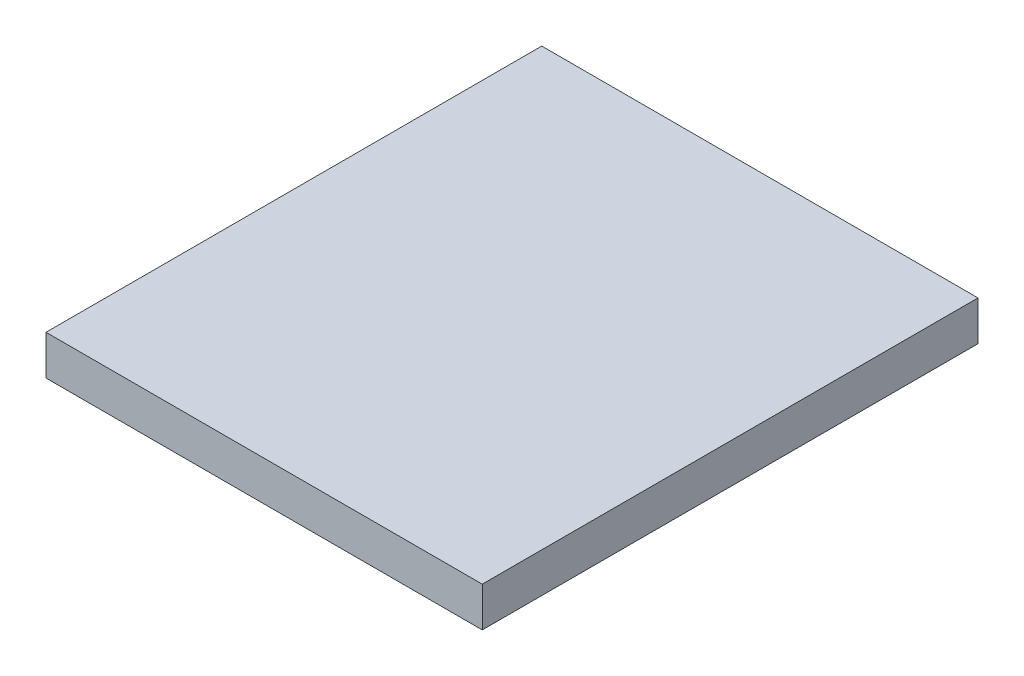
from build123d import *

# Parameters (mm, degrees)
SKETCH1_W           = 440
SKETCH1_H           = 500
BOSS_EXTRUDE1_DEPTH = 40


with BuildPart() as part:
    # Sketch1 → Boss-Extrude1 (new body)
    with BuildSketch(Plane(origin=(0, 0, 0), x_dir=(1, 0, 0), z_dir=(0, 1, 0))):
        Rectangle(SKETCH1_W, SKETCH1_H)
    extrude(amount=BOSS_EXTRUDE1_DEPTH)


solid = part.part
